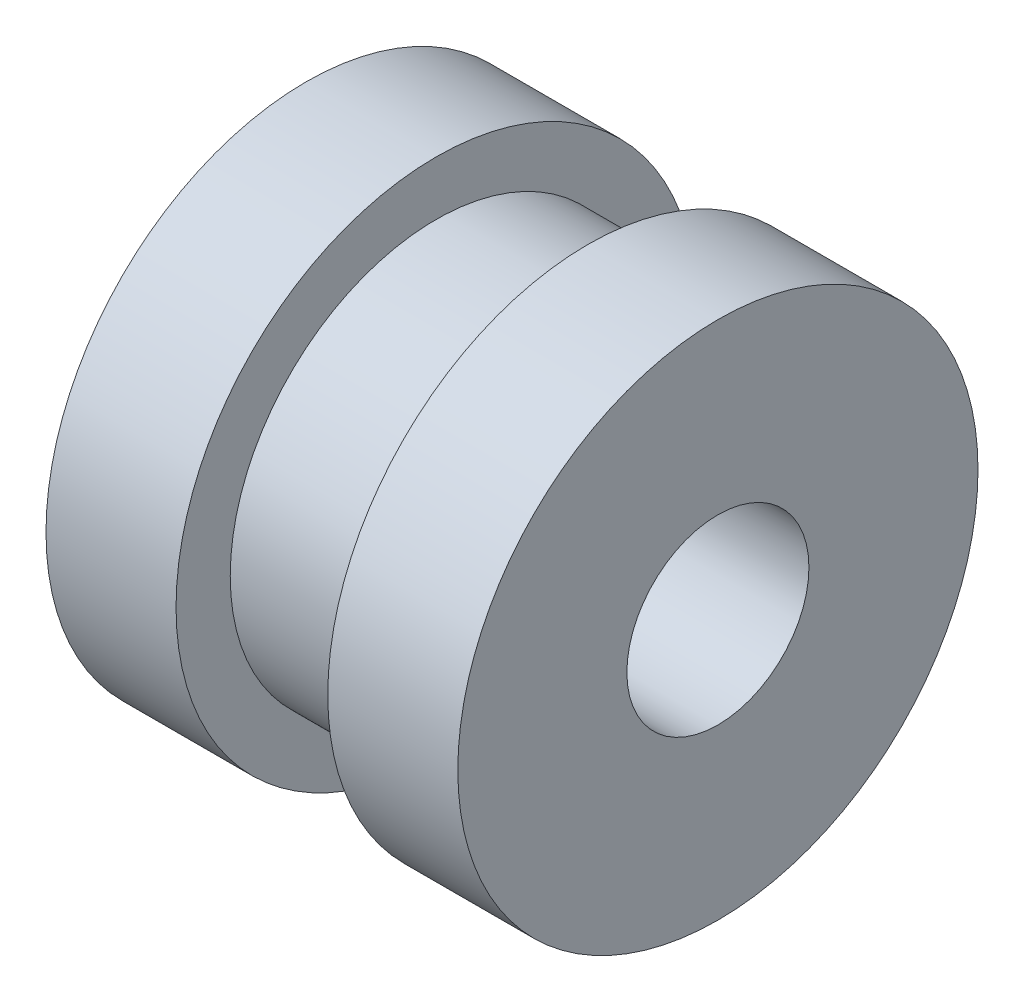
from build123d import *

# Parameters (mm, degrees)
M5_TAPPED_HOLE1_D = 4.2


with BuildPart() as part:
    # Sketch1 → Revolve1 (revolve)
    with BuildSketch(Plane(origin=(0, 0, 0), x_dir=(1, 0, 0), z_dir=(0, 1, 0)), mode=Mode.PRIVATE) as revolve1_sk:
        Polygon((6.5, 4.75), (6.5, 6), (9.5, 6), (9.5, 0), (0, 0), (0, 6), (3, 6), (3, 4.75), align=None)
    revolve(revolve1_sk.sketch.rotate(Axis((0, 0, 0), (1, 0, 0)), 180), axis=Axis((0, 0, 0), (1, 0, 0)))

    # M5 Tapped Hole1 (through all)
    with Locations(Plane(origin=(9.5, 0, 0), x_dir=(0, 0, 1), z_dir=(1, 0, 0))):
        with Locations((0, 0)):
            Hole(M5_TAPPED_HOLE1_D / 2)


solid = part.part
